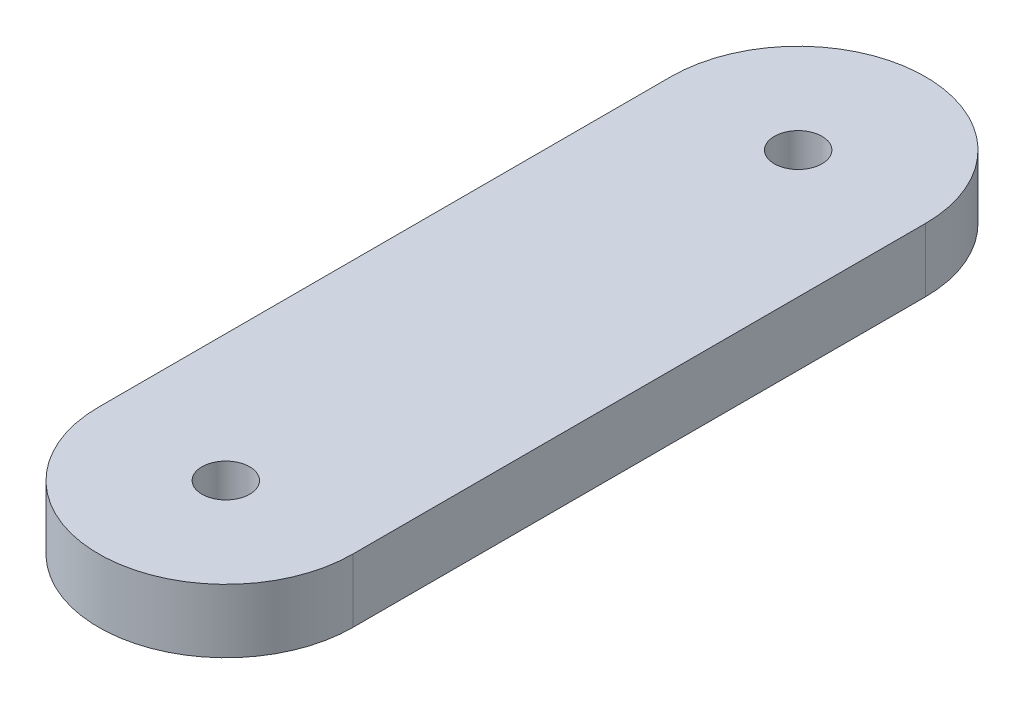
ISO-10303-21;
HEADER;
FILE_DESCRIPTION(('STEP AP214'),'2;1');
FILE_NAME('part.step','',(''),(''),'','','');
FILE_SCHEMA(('AUTOMOTIVE_DESIGN { 1 0 10303 214 1 1 1 1 }'));
ENDSEC;
DATA;
#1=APPLICATION_CONTEXT('core data for automotive mechanical design processes');
#2=APPLICATION_PROTOCOL_DEFINITION('international standard','automotive_design',2000,#1);
#3=PRODUCT_CONTEXT('',#1,'mechanical');
#4=PRODUCT('Part','Part','',(#3));
#5=PRODUCT_RELATED_PRODUCT_CATEGORY('part','',(#4));
#6=PRODUCT_DEFINITION_FORMATION('','',#4);
#7=PRODUCT_DEFINITION_CONTEXT('part definition',#1,'design');
#8=PRODUCT_DEFINITION('design','',#6,#7);
#9=PRODUCT_DEFINITION_SHAPE('','',#8);
#10=(LENGTH_UNIT() NAMED_UNIT(*) SI_UNIT(.MILLI.,.METRE.));
#11=(NAMED_UNIT(*) PLANE_ANGLE_UNIT() SI_UNIT($,.RADIAN.));
#12=(NAMED_UNIT(*) SI_UNIT($,.STERADIAN.) SOLID_ANGLE_UNIT());
#13=UNCERTAINTY_MEASURE_WITH_UNIT(LENGTH_MEASURE(1.E-05),#10,'distance_accuracy_value','');
#14=(GEOMETRIC_REPRESENTATION_CONTEXT(3) GLOBAL_UNCERTAINTY_ASSIGNED_CONTEXT((#13)) GLOBAL_UNIT_ASSIGNED_CONTEXT((#10,
#11,#12)) REPRESENTATION_CONTEXT('',''));
#15=CARTESIAN_POINT('',(0.,0.,0.));
#16=DIRECTION('',(0.,0.,1.));
#17=DIRECTION('',(1.,0.,0.));
#18=AXIS2_PLACEMENT_3D('',#15,#16,#17);
#19=CARTESIAN_POINT('',(0.,2.,0.));
#20=DIRECTION('',(0.,1.,0.));
#21=DIRECTION('',(0.,0.,1.));
#22=AXIS2_PLACEMENT_3D('',#19,#20,#21);
#23=PLANE('',#22);
#24=CARTESIAN_POINT('',(0.,2.,18.));
#25=DIRECTION('',(0.,1.,0.));
#26=DIRECTION('',(0.,0.,1.));
#27=AXIS2_PLACEMENT_3D('',#24,#25,#26);
#28=CIRCLE('',#27,1.5);
#29=CARTESIAN_POINT('',(0.,2.,19.5));
#30=VERTEX_POINT('',#29);
#31=EDGE_CURVE('E100',#30,#30,#28,.F.);
#32=ORIENTED_EDGE('',*,*,#31,.T.);
#33=EDGE_LOOP('',(#32));
#34=FACE_BOUND('',#33,.T.);
#35=CARTESIAN_POINT('',(0.,2.,-18.));
#36=DIRECTION('',(0.,1.,0.));
#37=DIRECTION('',(0.,0.,1.));
#38=AXIS2_PLACEMENT_3D('',#35,#36,#37);
#39=CIRCLE('',#38,1.5);
#40=CARTESIAN_POINT('',(0.,2.,-16.5));
#41=VERTEX_POINT('',#40);
#42=EDGE_CURVE('E104',#41,#41,#39,.F.);
#43=ORIENTED_EDGE('',*,*,#42,.T.);
#44=EDGE_LOOP('',(#43));
#45=FACE_BOUND('',#44,.T.);
#46=DIRECTION('',(0.,0.,-1.));
#47=VECTOR('',#46,1.);
#48=CARTESIAN_POINT('',(8.,2.,18.));
#49=LINE('',#48,#47);
#50=CARTESIAN_POINT('',(8.,2.,-18.));
#51=VERTEX_POINT('',#50);
#52=CARTESIAN_POINT('',(8.,2.,18.));
#53=VERTEX_POINT('',#52);
#54=EDGE_CURVE('E75',#51,#53,#49,.F.);
#55=ORIENTED_EDGE('',*,*,#54,.F.);
#56=CARTESIAN_POINT('',(0.,2.,-18.));
#57=DIRECTION('',(0.,1.,0.));
#58=DIRECTION('',(0.,0.,1.));
#59=AXIS2_PLACEMENT_3D('',#56,#57,#58);
#60=CIRCLE('',#59,8.);
#61=CARTESIAN_POINT('',(-8.,2.,-18.));
#62=VERTEX_POINT('',#61);
#63=EDGE_CURVE('E20',#62,#51,#60,.F.);
#64=ORIENTED_EDGE('',*,*,#63,.F.);
#65=DIRECTION('',(0.,0.,1.));
#66=VECTOR('',#65,1.);
#67=CARTESIAN_POINT('',(-8.,2.,-18.));
#68=LINE('',#67,#66);
#69=CARTESIAN_POINT('',(-8.,2.,18.));
#70=VERTEX_POINT('',#69);
#71=EDGE_CURVE('E61',#70,#62,#68,.F.);
#72=ORIENTED_EDGE('',*,*,#71,.F.);
#73=CARTESIAN_POINT('',(0.,2.,18.));
#74=DIRECTION('',(0.,1.,0.));
#75=DIRECTION('',(0.,0.,1.));
#76=AXIS2_PLACEMENT_3D('',#73,#74,#75);
#77=CIRCLE('',#76,8.);
#78=EDGE_CURVE('E82',#53,#70,#77,.F.);
#79=ORIENTED_EDGE('',*,*,#78,.F.);
#80=EDGE_LOOP('',(#55,#64,#72,#79));
#81=FACE_BOUND('',#80,.T.);
#82=ADVANCED_FACE('F17',(#34,#45,#81),#23,.T.);
#83=CARTESIAN_POINT('',(0.,-2.,-18.));
#84=DIRECTION('',(0.,1.,0.));
#85=DIRECTION('',(0.,0.,1.));
#86=AXIS2_PLACEMENT_3D('',#83,#84,#85);
#87=CYLINDRICAL_SURFACE('',#86,8.);
#88=DIRECTION('',(0.,1.,0.));
#89=VECTOR('',#88,1.);
#90=CARTESIAN_POINT('',(8.,-2.,-18.));
#91=LINE('',#90,#89);
#92=CARTESIAN_POINT('',(8.,-2.,-18.));
#93=VERTEX_POINT('',#92);
#94=EDGE_CURVE('E89',#93,#51,#91,.T.);
#95=ORIENTED_EDGE('',*,*,#94,.F.);
#96=CARTESIAN_POINT('',(0.,-2.,-18.));
#97=DIRECTION('',(0.,1.,0.));
#98=DIRECTION('',(0.,0.,1.));
#99=AXIS2_PLACEMENT_3D('',#96,#97,#98);
#100=CIRCLE('',#99,8.);
#101=CARTESIAN_POINT('',(-8.,-2.,-18.));
#102=VERTEX_POINT('',#101);
#103=EDGE_CURVE('E81',#93,#102,#100,.T.);
#104=ORIENTED_EDGE('',*,*,#103,.T.);
#105=DIRECTION('',(0.,1.,0.));
#106=VECTOR('',#105,1.);
#107=CARTESIAN_POINT('',(-8.,-2.,-18.));
#108=LINE('',#107,#106);
#109=EDGE_CURVE('E66',#62,#102,#108,.F.);
#110=ORIENTED_EDGE('',*,*,#109,.F.);
#111=ORIENTED_EDGE('',*,*,#63,.T.);
#112=EDGE_LOOP('',(#95,#104,#110,#111));
#113=FACE_BOUND('',#112,.T.);
#114=ADVANCED_FACE('F80',(#113),#87,.T.);
#115=CARTESIAN_POINT('',(-8.,-2.,-18.));
#116=DIRECTION('',(-1.,0.,0.));
#117=DIRECTION('',(0.,0.,1.));
#118=AXIS2_PLACEMENT_3D('',#115,#116,#117);
#119=PLANE('',#118);
#120=ORIENTED_EDGE('',*,*,#109,.T.);
#121=DIRECTION('',(0.,0.,1.));
#122=VECTOR('',#121,1.);
#123=CARTESIAN_POINT('',(-8.,-2.,0.));
#124=LINE('',#123,#122);
#125=CARTESIAN_POINT('',(-8.,-2.,18.));
#126=VERTEX_POINT('',#125);
#127=EDGE_CURVE('E98',#102,#126,#124,.T.);
#128=ORIENTED_EDGE('',*,*,#127,.T.);
#129=DIRECTION('',(0.,1.,0.));
#130=VECTOR('',#129,1.);
#131=CARTESIAN_POINT('',(-8.,-2.,18.));
#132=LINE('',#131,#130);
#133=EDGE_CURVE('E68',#70,#126,#132,.F.);
#134=ORIENTED_EDGE('',*,*,#133,.F.);
#135=ORIENTED_EDGE('',*,*,#71,.T.);
#136=EDGE_LOOP('',(#120,#128,#134,#135));
#137=FACE_BOUND('',#136,.T.);
#138=ADVANCED_FACE('F63',(#137),#119,.T.);
#139=CARTESIAN_POINT('',(0.,-2.,18.));
#140=DIRECTION('',(0.,1.,0.));
#141=DIRECTION('',(0.,0.,1.));
#142=AXIS2_PLACEMENT_3D('',#139,#140,#141);
#143=CYLINDRICAL_SURFACE('',#142,8.);
#144=ORIENTED_EDGE('',*,*,#133,.T.);
#145=CARTESIAN_POINT('',(0.,-2.,18.));
#146=DIRECTION('',(0.,1.,0.));
#147=DIRECTION('',(0.,0.,1.));
#148=AXIS2_PLACEMENT_3D('',#145,#146,#147);
#149=CIRCLE('',#148,8.);
#150=CARTESIAN_POINT('',(8.,-2.,18.));
#151=VERTEX_POINT('',#150);
#152=EDGE_CURVE('E94',#126,#151,#149,.T.);
#153=ORIENTED_EDGE('',*,*,#152,.T.);
#154=DIRECTION('',(0.,1.,0.));
#155=VECTOR('',#154,1.);
#156=CARTESIAN_POINT('',(8.,-2.,18.));
#157=LINE('',#156,#155);
#158=EDGE_CURVE('E40',#53,#151,#157,.F.);
#159=ORIENTED_EDGE('',*,*,#158,.F.);
#160=ORIENTED_EDGE('',*,*,#78,.T.);
#161=EDGE_LOOP('',(#144,#153,#159,#160));
#162=FACE_BOUND('',#161,.T.);
#163=ADVANCED_FACE('F116',(#162),#143,.T.);
#164=CARTESIAN_POINT('',(8.,-2.,18.));
#165=DIRECTION('',(1.,0.,0.));
#166=DIRECTION('',(0.,0.,-1.));
#167=AXIS2_PLACEMENT_3D('',#164,#165,#166);
#168=PLANE('',#167);
#169=ORIENTED_EDGE('',*,*,#158,.T.);
#170=DIRECTION('',(0.,0.,1.));
#171=VECTOR('',#170,1.);
#172=CARTESIAN_POINT('',(8.,-2.,0.));
#173=LINE('',#172,#171);
#174=EDGE_CURVE('E93',#151,#93,#173,.F.);
#175=ORIENTED_EDGE('',*,*,#174,.T.);
#176=ORIENTED_EDGE('',*,*,#94,.T.);
#177=ORIENTED_EDGE('',*,*,#54,.T.);
#178=EDGE_LOOP('',(#169,#175,#176,#177));
#179=FACE_BOUND('',#178,.T.);
#180=ADVANCED_FACE('F123',(#179),#168,.T.);
#181=CARTESIAN_POINT('',(0.,-2.,-18.));
#182=DIRECTION('',(0.,1.,0.));
#183=DIRECTION('',(0.,0.,1.));
#184=AXIS2_PLACEMENT_3D('',#181,#182,#183);
#185=CYLINDRICAL_SURFACE('',#184,1.5);
#186=ORIENTED_EDGE('',*,*,#42,.F.);
#187=EDGE_LOOP('',(#186));
#188=FACE_BOUND('',#187,.T.);
#189=CARTESIAN_POINT('',(0.,-2.,-18.));
#190=DIRECTION('',(0.,1.,0.));
#191=DIRECTION('',(0.,0.,1.));
#192=AXIS2_PLACEMENT_3D('',#189,#190,#191);
#193=CIRCLE('',#192,1.5);
#194=CARTESIAN_POINT('',(0.,-2.,-16.5));
#195=VERTEX_POINT('',#194);
#196=EDGE_CURVE('E27',#195,#195,#193,.F.);
#197=ORIENTED_EDGE('',*,*,#196,.T.);
#198=EDGE_LOOP('',(#197));
#199=FACE_BOUND('',#198,.T.);
#200=ADVANCED_FACE('F125',(#188,#199),#185,.F.);
#201=CARTESIAN_POINT('',(0.,-2.,18.));
#202=DIRECTION('',(0.,1.,0.));
#203=DIRECTION('',(0.,0.,1.));
#204=AXIS2_PLACEMENT_3D('',#201,#202,#203);
#205=CYLINDRICAL_SURFACE('',#204,1.5);
#206=ORIENTED_EDGE('',*,*,#31,.F.);
#207=EDGE_LOOP('',(#206));
#208=FACE_BOUND('',#207,.T.);
#209=CARTESIAN_POINT('',(0.,-2.,18.));
#210=DIRECTION('',(0.,1.,0.));
#211=DIRECTION('',(0.,0.,1.));
#212=AXIS2_PLACEMENT_3D('',#209,#210,#211);
#213=CIRCLE('',#212,1.5);
#214=CARTESIAN_POINT('',(0.,-2.,19.5));
#215=VERTEX_POINT('',#214);
#216=EDGE_CURVE('E11',#215,#215,#213,.F.);
#217=ORIENTED_EDGE('',*,*,#216,.T.);
#218=EDGE_LOOP('',(#217));
#219=FACE_BOUND('',#218,.T.);
#220=ADVANCED_FACE('F132',(#208,#219),#205,.F.);
#221=CARTESIAN_POINT('',(0.,-2.,0.));
#222=DIRECTION('',(0.,1.,0.));
#223=DIRECTION('',(0.,0.,1.));
#224=AXIS2_PLACEMENT_3D('',#221,#222,#223);
#225=PLANE('',#224);
#226=ORIENTED_EDGE('',*,*,#216,.F.);
#227=EDGE_LOOP('',(#226));
#228=FACE_BOUND('',#227,.T.);
#229=ORIENTED_EDGE('',*,*,#196,.F.);
#230=EDGE_LOOP('',(#229));
#231=FACE_BOUND('',#230,.T.);
#232=ORIENTED_EDGE('',*,*,#152,.F.);
#233=ORIENTED_EDGE('',*,*,#127,.F.);
#234=ORIENTED_EDGE('',*,*,#103,.F.);
#235=ORIENTED_EDGE('',*,*,#174,.F.);
#236=EDGE_LOOP('',(#232,#233,#234,#235));
#237=FACE_BOUND('',#236,.T.);
#238=ADVANCED_FACE('F118',(#228,#231,#237),#225,.F.);
#239=CLOSED_SHELL('',(#82,#114,#138,#163,#180,#200,#220,#238));
#240=MANIFOLD_SOLID_BREP('B1',#239);
#241=ADVANCED_BREP_SHAPE_REPRESENTATION('',(#18,#240),#14);
#242=SHAPE_DEFINITION_REPRESENTATION(#9,#241);
ENDSEC;
END-ISO-10303-21;
